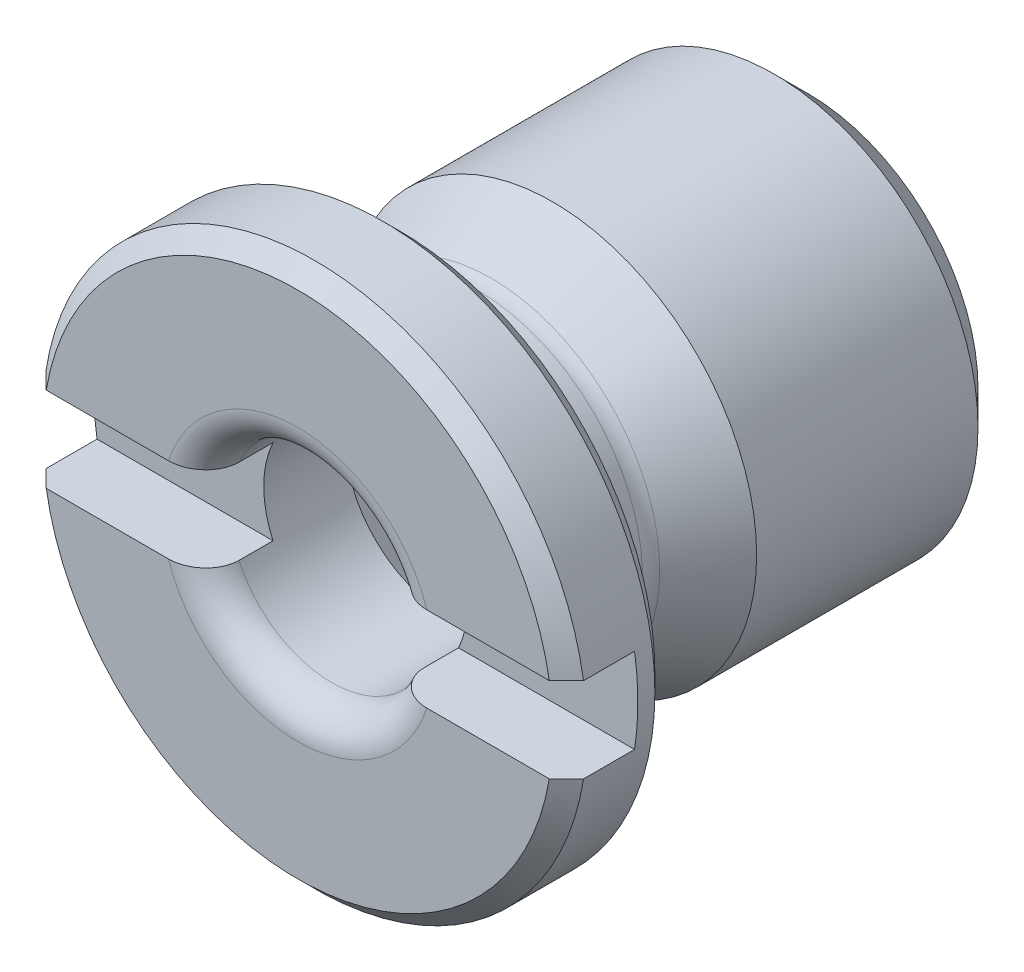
ISO-10303-21;
HEADER;
FILE_DESCRIPTION(('STEP AP214'),'2;1');
FILE_NAME('part.step','',(''),(''),'','','');
FILE_SCHEMA(('AUTOMOTIVE_DESIGN { 1 0 10303 214 1 1 1 1 }'));
ENDSEC;
DATA;
#1=APPLICATION_CONTEXT('core data for automotive mechanical design processes');
#2=APPLICATION_PROTOCOL_DEFINITION('international standard','automotive_design',2000,#1);
#3=PRODUCT_CONTEXT('',#1,'mechanical');
#4=PRODUCT('Part','Part','',(#3));
#5=PRODUCT_RELATED_PRODUCT_CATEGORY('part','',(#4));
#6=PRODUCT_DEFINITION_FORMATION('','',#4);
#7=PRODUCT_DEFINITION_CONTEXT('part definition',#1,'design');
#8=PRODUCT_DEFINITION('design','',#6,#7);
#9=PRODUCT_DEFINITION_SHAPE('','',#8);
#10=(LENGTH_UNIT() NAMED_UNIT(*) SI_UNIT(.MILLI.,.METRE.));
#11=(NAMED_UNIT(*) PLANE_ANGLE_UNIT() SI_UNIT($,.RADIAN.));
#12=(NAMED_UNIT(*) SI_UNIT($,.STERADIAN.) SOLID_ANGLE_UNIT());
#13=UNCERTAINTY_MEASURE_WITH_UNIT(LENGTH_MEASURE(1.E-05),#10,'distance_accuracy_value','');
#14=(GEOMETRIC_REPRESENTATION_CONTEXT(3) GLOBAL_UNCERTAINTY_ASSIGNED_CONTEXT((#13)) GLOBAL_UNIT_ASSIGNED_CONTEXT((#10,
#11,#12)) REPRESENTATION_CONTEXT('',''));
#15=CARTESIAN_POINT('',(0.,0.,0.));
#16=DIRECTION('',(0.,0.,1.));
#17=DIRECTION('',(1.,0.,0.));
#18=AXIS2_PLACEMENT_3D('',#15,#16,#17);
#19=CARTESIAN_POINT('',(0.,8.,3.));
#20=DIRECTION('',(0.,0.,-1.));
#21=DIRECTION('',(-1.,0.,0.));
#22=AXIS2_PLACEMENT_3D('',#19,#20,#21);
#23=PLANE('',#22);
#24=DIRECTION('',(-1.,0.,0.));
#25=VECTOR('',#24,1.);
#26=CARTESIAN_POINT('',(13.,-1.25,3.));
#27=LINE('',#26,#25);
#28=CARTESIAN_POINT('',(7.39509972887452,-1.25,3.));
#29=VERTEX_POINT('',#28);
#30=CARTESIAN_POINT('',(3.79967103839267,-1.25,3.));
#31=VERTEX_POINT('',#30);
#32=EDGE_CURVE('E282',#29,#31,#27,.T.);
#33=ORIENTED_EDGE('',*,*,#32,.T.);
#34=CARTESIAN_POINT('',(0.,0.,3.));
#35=DIRECTION('',(0.,0.,-1.));
#36=DIRECTION('',(-1.,0.,0.));
#37=AXIS2_PLACEMENT_3D('',#34,#35,#36);
#38=CIRCLE('',#37,4.);
#39=CARTESIAN_POINT('',(-3.79967103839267,-1.25,3.));
#40=VERTEX_POINT('',#39);
#41=EDGE_CURVE('E381',#31,#40,#38,.T.);
#42=ORIENTED_EDGE('',*,*,#41,.T.);
#43=CARTESIAN_POINT('',(-7.39509972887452,-1.25,3.));
#44=VERTEX_POINT('',#43);
#45=EDGE_CURVE('E286',#40,#44,#27,.T.);
#46=ORIENTED_EDGE('',*,*,#45,.T.);
#47=CARTESIAN_POINT('',(0.,0.,3.));
#48=DIRECTION('',(0.,0.,-1.));
#49=DIRECTION('',(-1.,0.,0.));
#50=AXIS2_PLACEMENT_3D('',#47,#48,#49);
#51=CIRCLE('',#50,7.5);
#52=EDGE_CURVE('E129',#44,#29,#51,.F.);
#53=ORIENTED_EDGE('',*,*,#52,.T.);
#54=EDGE_LOOP('',(#33,#42,#46,#53));
#55=FACE_BOUND('',#54,.T.);
#56=ADVANCED_FACE('F14',(#55),#23,.F.);
#57=CARTESIAN_POINT('',(0.,0.,2.5));
#58=DIRECTION('',(0.,0.,-1.));
#59=DIRECTION('',(-1.,0.,0.));
#60=AXIS2_PLACEMENT_3D('',#57,#58,#59);
#61=CONICAL_SURFACE('',#60,8.,0.785398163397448);
#62=CARTESIAN_POINT('',(-17.5604533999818,-1.25,-7.10488635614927));
#63=CARTESIAN_POINT('',(-16.950821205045,-1.25,-6.49680525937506));
#64=CARTESIAN_POINT('',(-16.3411209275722,-1.25,-5.88879236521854));
#65=CARTESIAN_POINT('',(-15.1214785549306,-1.25,-4.67297511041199));
#66=CARTESIAN_POINT('',(-14.5115364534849,-1.25,-4.06517075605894));
#67=CARTESIAN_POINT('',(-13.2909447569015,-1.25,-2.84948420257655));
#68=CARTESIAN_POINT('',(-12.680294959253,-1.25,-2.241602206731));
#69=CARTESIAN_POINT('',(-11.458531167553,-1.25,-1.02633810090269));
#70=CARTESIAN_POINT('',(-10.847417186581,-1.25,-0.418955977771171));
#71=CARTESIAN_POINT('',(-9.62720680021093,-1.25,0.792268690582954));
#72=CARTESIAN_POINT('',(-9.01811388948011,-1.25,1.39611475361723));
#73=CARTESIAN_POINT('',(-8.10341366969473,-1.25,2.30086267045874));
#74=CARTESIAN_POINT('',(-7.79832397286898,-1.25,2.60228773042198));
#75=CARTESIAN_POINT('',(-7.18765459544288,-1.25,3.20463642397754));
#76=CARTESIAN_POINT('',(-6.88207491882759,-1.25,3.50556006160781));
#77=CARTESIAN_POINT('',(-6.27031901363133,-1.25,4.10655488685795));
#78=CARTESIAN_POINT('',(-5.96414307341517,-1.25,4.40662636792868));
#79=CARTESIAN_POINT('',(-5.35068118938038,-1.25,5.00565392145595));
#80=CARTESIAN_POINT('',(-5.04339521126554,-1.25,5.30460995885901));
#81=CARTESIAN_POINT('',(-4.58109789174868,-1.25,5.75158524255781));
#82=CARTESIAN_POINT('',(-4.42678181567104,-1.25,5.90032328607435));
#83=CARTESIAN_POINT('',(-4.11752037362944,-1.25,6.19714337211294));
#84=CARTESIAN_POINT('',(-3.9625750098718,-1.25,6.34522541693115));
#85=CARTESIAN_POINT('',(-3.65182467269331,-1.25,6.64046971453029));
#86=CARTESIAN_POINT('',(-3.49601974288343,-1.25,6.78763201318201));
#87=CARTESIAN_POINT('',(-3.18317307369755,-1.25,7.08063490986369));
#88=CARTESIAN_POINT('',(-3.02613135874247,-1.25,7.22647553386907));
#89=CARTESIAN_POINT('',(-2.8250301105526,-1.25,7.4108245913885));
#90=CARTESIAN_POINT('',(-2.78183756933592,-1.25,7.45027895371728));
#91=CARTESIAN_POINT('',(-2.69529179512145,-1.25,7.52901128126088));
#92=CARTESIAN_POINT('',(-2.65193856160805,-1.25,7.56828924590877));
#93=CARTESIAN_POINT('',(-2.52160414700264,-1.25,7.68582638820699));
#94=CARTESIAN_POINT('',(-2.43435172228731,-1.25,7.76378562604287));
#95=CARTESIAN_POINT('',(-2.25872855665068,-1.25,7.91878995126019));
#96=CARTESIAN_POINT('',(-2.17035593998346,-1.25,7.99583291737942));
#97=CARTESIAN_POINT('',(-1.99235025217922,-1.25,8.14843615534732));
#98=CARTESIAN_POINT('',(-1.90271731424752,-1.25,8.22399658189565));
#99=CARTESIAN_POINT('',(-1.7333511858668,-1.25,8.36341345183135));
#100=CARTESIAN_POINT('',(-1.65382849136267,-1.25,8.4275246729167));
#101=CARTESIAN_POINT('',(-1.49299470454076,-1.25,8.55345850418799));
#102=CARTESIAN_POINT('',(-1.41168384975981,-1.25,8.61528141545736));
#103=CARTESIAN_POINT('',(-1.24666606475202,-1.25,8.73549616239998));
#104=CARTESIAN_POINT('',(-1.16296158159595,-1.25,8.79389132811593));
#105=CARTESIAN_POINT('',(-0.992151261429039,-1.25,8.90542519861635));
#106=CARTESIAN_POINT('',(-0.905048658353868,-1.25,8.95856873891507));
#107=CARTESIAN_POINT('',(-0.736300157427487,-1.25,9.05078656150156));
#108=CARTESIAN_POINT('',(-0.65516301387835,-1.25,9.09077392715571));
#109=CARTESIAN_POINT('',(-0.488404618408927,-1.25,9.16009046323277));
#110=CARTESIAN_POINT('',(-0.40279537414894,-1.25,9.18944664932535));
#111=CARTESIAN_POINT('',(-0.27938221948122,-1.25,9.21963281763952));
#112=CARTESIAN_POINT('',(-0.243181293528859,-1.25,9.22707350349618));
#113=CARTESIAN_POINT('',(-0.170299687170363,-1.25,9.23896388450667));
#114=CARTESIAN_POINT('',(-0.133619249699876,-1.25,9.24341503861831));
#115=CARTESIAN_POINT('',(-0.0600463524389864,-1.25,9.24909491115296));
#116=CARTESIAN_POINT('',(-0.0231541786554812,-1.25,9.25032726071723));
#117=CARTESIAN_POINT('',(0.0505870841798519,-1.25,9.2495222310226));
#118=CARTESIAN_POINT('',(0.0874361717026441,-1.25,9.24748473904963));
#119=CARTESIAN_POINT('',(0.197234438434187,-1.25,9.2366140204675));
#120=CARTESIAN_POINT('',(0.269757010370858,-1.25,9.22304623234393));
#121=CARTESIAN_POINT('',(0.376421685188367,-1.25,9.19501276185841));
#122=CARTESIAN_POINT('',(0.411669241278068,-1.25,9.18436851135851));
#123=CARTESIAN_POINT('',(0.481433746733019,-1.25,9.16089365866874));
#124=CARTESIAN_POINT('',(0.515950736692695,-1.25,9.14806317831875));
#125=CARTESIAN_POINT('',(0.599451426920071,-1.25,9.11443359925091));
#126=CARTESIAN_POINT('',(0.648028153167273,-1.25,9.09263122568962));
#127=CARTESIAN_POINT('',(0.743752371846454,-1.25,9.04606609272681));
#128=CARTESIAN_POINT('',(0.790899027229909,-1.25,9.02130163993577));
#129=CARTESIAN_POINT('',(0.930636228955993,-1.25,8.94354849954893));
#130=CARTESIAN_POINT('',(1.02133654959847,-1.25,8.88718184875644));
#131=CARTESIAN_POINT('',(1.19991424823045,-1.25,8.76857603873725));
#132=CARTESIAN_POINT('',(1.28775773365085,-1.25,8.70628736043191));
#133=CARTESIAN_POINT('',(1.41751910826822,-1.25,8.61028376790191));
#134=CARTESIAN_POINT('',(1.46041248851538,-1.25,8.57787540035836));
#135=CARTESIAN_POINT('',(1.54564655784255,-1.25,8.51234314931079));
#136=CARTESIAN_POINT('',(1.58798726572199,-1.25,8.47921929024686));
#137=CARTESIAN_POINT('',(1.72647327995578,-1.25,8.36933062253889));
#138=CARTESIAN_POINT('',(1.82164106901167,-1.25,8.29133479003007));
#139=CARTESIAN_POINT('',(2.01029258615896,-1.25,8.13332745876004));
#140=CARTESIAN_POINT('',(2.10377612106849,-1.25,8.05331573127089));
#141=CARTESIAN_POINT('',(2.28954596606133,-1.25,7.89185697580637));
#142=CARTESIAN_POINT('',(2.38183187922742,-1.25,7.81040949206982));
#143=CARTESIAN_POINT('',(2.56548889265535,-1.25,7.64648823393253));
#144=CARTESIAN_POINT('',(2.65685997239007,-1.25,7.56401443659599));
#145=CARTESIAN_POINT('',(2.9301888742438,-1.25,7.3152315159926));
#146=CARTESIAN_POINT('',(3.11110918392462,-1.25,7.14778371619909));
#147=CARTESIAN_POINT('',(3.47122028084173,-1.25,6.81111827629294));
#148=CARTESIAN_POINT('',(3.65041140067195,-1.25,6.64190099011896));
#149=CARTESIAN_POINT('',(4.00643340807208,-1.25,6.30345611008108));
#150=CARTESIAN_POINT('',(4.18327204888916,-1.25,6.1342366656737));
#151=CARTESIAN_POINT('',(4.5361870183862,-1.25,5.79498793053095));
#152=CARTESIAN_POINT('',(4.71226330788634,-1.25,5.6249585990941));
#153=CARTESIAN_POINT('',(5.06372940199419,-1.25,5.28445006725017));
#154=CARTESIAN_POINT('',(5.23911961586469,-1.25,5.11397128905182));
#155=CARTESIAN_POINT('',(5.58947962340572,-1.25,4.7725881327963));
#156=CARTESIAN_POINT('',(5.76444942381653,-1.25,4.60168376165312));
#157=CARTESIAN_POINT('',(6.42446661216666,-1.25,3.95583307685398));
#158=CARTESIAN_POINT('',(6.90847532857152,-1.25,3.4798256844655));
#159=CARTESIAN_POINT('',(7.87525645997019,-1.25,2.52655148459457));
#160=CARTESIAN_POINT('',(8.35802886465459,-1.25,2.04928466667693));
#161=CARTESIAN_POINT('',(9.32297815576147,-1.25,1.09383964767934));
#162=CARTESIAN_POINT('',(9.80515480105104,-1.25,0.61566120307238));
#163=CARTESIAN_POINT('',(10.7690277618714,-1.25,-0.341176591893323));
#164=CARTESIAN_POINT('',(11.250724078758,-1.25,-0.819835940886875));
#165=CARTESIAN_POINT('',(12.2184744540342,-1.25,-1.78214023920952));
#166=CARTESIAN_POINT('',(12.7045253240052,-1.25,-2.26578839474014));
#167=CARTESIAN_POINT('',(13.6763923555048,-1.25,-3.23332135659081));
#168=CARTESIAN_POINT('',(14.1622085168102,-1.25,-3.71720616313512));
#169=CARTESIAN_POINT('',(15.1335034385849,-1.25,-4.68498319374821));
#170=CARTESIAN_POINT('',(15.6189822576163,-1.25,-5.16887535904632));
#171=CARTESIAN_POINT('',(16.5898072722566,-1.25,-6.13679168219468));
#172=CARTESIAN_POINT('',(17.0751534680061,-1.25,-6.62081583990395));
#173=CARTESIAN_POINT('',(17.5604533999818,-1.25,-7.10488635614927));
#174=B_SPLINE_CURVE_WITH_KNOTS('',3,(#62,#63,#64,#65,#66,#67,#68,#69,#70,#71,#72,#73,#74,#75,
#76,#77,#78,#79,#80,#81,#82,#83,#84,#85,#86,#87,#88,#89,#90,#91,#92,#93,#94,#95,#96,#97,#98,#99,
#100,#101,#102,#103,#104,#105,#106,#107,#108,#109,#110,#111,#112,#113,#114,#115,#116,#117,#118,
#119,#120,#121,#122,#123,#124,#125,#126,#127,#128,#129,#130,#131,#132,#133,#134,#135,#136,#137,
#138,#139,#140,#141,#142,#143,#144,#145,#146,#147,#148,#149,#150,#151,#152,#153,#154,#155,#156,
#157,#158,#159,#160,#161,#162,#163,#164,#165,#166,#167,#168,#169,#170,#171,#172,#173),
.UNSPECIFIED.,.F.,.F.,(4,2,2,2,2,2,2,2,2,2,2,2,2,2,2,2,2,2,2,2,2,2,2,2,2,2,2,2,2,2,2,2,2,2,2,2,
2,2,2,2,2,2,2,2,2,2,2,2,2,2,2,2,2,2,2,4),(0.,2.58316212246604,5.1663963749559,7.75129912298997,
10.3361315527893,12.9091862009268,14.1958214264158,15.4824462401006,16.768555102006,
18.0547040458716,18.6976865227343,19.3406667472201,19.9836146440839,20.6265498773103,
20.8020492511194,20.9775491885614,21.3285632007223,21.6802738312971,22.0319475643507,
22.3383624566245,22.6447368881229,22.9508085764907,23.25659576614,23.5275479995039,
23.7978067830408,23.9085745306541,24.0192881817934,24.1298768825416,24.240469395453,
24.4606980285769,24.5711090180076,24.6815138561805,24.8411128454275,25.000803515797,
25.3207954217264,25.6437486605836,25.805021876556,25.9662895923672,26.3353779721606,
26.704508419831,27.0737582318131,27.4430163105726,28.1825441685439,28.9219268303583,
29.6562008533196,30.3905121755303,31.1242840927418,31.8580441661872,33.8946107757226,
35.9311943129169,37.9684321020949,40.0056641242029,42.0627125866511,44.1197630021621,
46.1761121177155,48.2324590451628),.UNSPECIFIED.);
#175=CARTESIAN_POINT('',(-7.90174031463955,-1.25,2.5));
#176=VERTEX_POINT('',#175);
#177=EDGE_CURVE('E384',#176,#44,#174,.T.);
#178=ORIENTED_EDGE('',*,*,#177,.F.);
#179=CARTESIAN_POINT('',(0.,0.,2.5));
#180=DIRECTION('',(0.,0.,-1.));
#181=DIRECTION('',(-1.,0.,0.));
#182=AXIS2_PLACEMENT_3D('',#179,#180,#181);
#183=CIRCLE('',#182,8.);
#184=CARTESIAN_POINT('',(7.90174031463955,-1.25,2.5));
#185=VERTEX_POINT('',#184);
#186=EDGE_CURVE('E265',#185,#176,#183,.T.);
#187=ORIENTED_EDGE('',*,*,#186,.F.);
#188=EDGE_CURVE('E116',#29,#185,#174,.T.);
#189=ORIENTED_EDGE('',*,*,#188,.F.);
#190=ORIENTED_EDGE('',*,*,#52,.F.);
#191=EDGE_LOOP('',(#178,#187,#189,#190));
#192=FACE_BOUND('',#191,.T.);
#193=ADVANCED_FACE('F196',(#192),#61,.T.);
#194=CARTESIAN_POINT('',(0.,0.,-17.5262382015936));
#195=DIRECTION('',(0.,0.,-1.));
#196=DIRECTION('',(-1.,0.,0.));
#197=AXIS2_PLACEMENT_3D('',#194,#195,#196);
#198=CYLINDRICAL_SURFACE('',#197,4.85);
#199=CARTESIAN_POINT('',(0.,0.,-0.8));
#200=DIRECTION('',(0.,0.,1.));
#201=DIRECTION('',(1.,0.,0.));
#202=AXIS2_PLACEMENT_3D('',#199,#200,#201);
#203=CIRCLE('',#202,4.85);
#204=CARTESIAN_POINT('',(4.85,0.,-0.8));
#205=VERTEX_POINT('',#204);
#206=EDGE_CURVE('E352',#205,#205,#203,.F.);
#207=ORIENTED_EDGE('',*,*,#206,.T.);
#208=EDGE_LOOP('',(#207));
#209=FACE_BOUND('',#208,.T.);
#210=CARTESIAN_POINT('',(0.,0.,-2.2856406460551));
#211=DIRECTION('',(0.,0.,-1.));
#212=DIRECTION('',(-1.,0.,0.));
#213=AXIS2_PLACEMENT_3D('',#210,#211,#212);
#214=CIRCLE('',#213,4.85);
#215=CARTESIAN_POINT('',(-4.85,0.,-2.2856406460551));
#216=VERTEX_POINT('',#215);
#217=EDGE_CURVE('E350',#216,#216,#214,.F.);
#218=ORIENTED_EDGE('',*,*,#217,.T.);
#219=EDGE_LOOP('',(#218));
#220=FACE_BOUND('',#219,.T.);
#221=ADVANCED_FACE('F203',(#209,#220),#198,.T.);
#222=CARTESIAN_POINT('',(0.,0.,-2.5));
#223=DIRECTION('',(0.,0.,-1.));
#224=DIRECTION('',(-1.,0.,0.));
#225=AXIS2_PLACEMENT_3D('',#222,#223,#224);
#226=CONICAL_SURFACE('',#225,4.85,0.523598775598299);
#227=CARTESIAN_POINT('',(0.,0.,-2.68564064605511));
#228=DIRECTION('',(0.,0.,-1.));
#229=DIRECTION('',(-1.,0.,0.));
#230=AXIS2_PLACEMENT_3D('',#227,#228,#229);
#231=CIRCLE('',#230,4.95717967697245);
#232=CARTESIAN_POINT('',(-4.95717967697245,0.,-2.68564064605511));
#233=VERTEX_POINT('',#232);
#234=EDGE_CURVE('E9',#233,#233,#231,.T.);
#235=ORIENTED_EDGE('',*,*,#234,.T.);
#236=EDGE_LOOP('',(#235));
#237=FACE_BOUND('',#236,.T.);
#238=CARTESIAN_POINT('',(0.,0.,-4.49185842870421));
#239=DIRECTION('',(0.,0.,-1.));
#240=DIRECTION('',(-1.,0.,0.));
#241=AXIS2_PLACEMENT_3D('',#238,#239,#240);
#242=CIRCLE('',#241,6.);
#243=CARTESIAN_POINT('',(-6.,0.,-4.49185842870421));
#244=VERTEX_POINT('',#243);
#245=EDGE_CURVE('E266',#244,#244,#242,.T.);
#246=ORIENTED_EDGE('',*,*,#245,.F.);
#247=EDGE_LOOP('',(#246));
#248=FACE_BOUND('',#247,.T.);
#249=ADVANCED_FACE('F242',(#237,#248),#226,.T.);
#250=CARTESIAN_POINT('',(0.,0.,-17.5262382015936));
#251=DIRECTION('',(0.,0.,-1.));
#252=DIRECTION('',(-1.,0.,0.));
#253=AXIS2_PLACEMENT_3D('',#250,#251,#252);
#254=CYLINDRICAL_SURFACE('',#253,6.);
#255=CARTESIAN_POINT('',(0.,0.,-11.));
#256=DIRECTION('',(0.,0.,-1.));
#257=DIRECTION('',(-1.,0.,0.));
#258=AXIS2_PLACEMENT_3D('',#255,#256,#257);
#259=CIRCLE('',#258,6.);
#260=CARTESIAN_POINT('',(-6.,0.,-11.));
#261=VERTEX_POINT('',#260);
#262=EDGE_CURVE('E270',#261,#261,#259,.T.);
#263=ORIENTED_EDGE('',*,*,#262,.F.);
#264=EDGE_LOOP('',(#263));
#265=FACE_BOUND('',#264,.T.);
#266=ORIENTED_EDGE('',*,*,#245,.T.);
#267=EDGE_LOOP('',(#266));
#268=FACE_BOUND('',#267,.T.);
#269=ADVANCED_FACE('F238',(#265,#268),#254,.T.);
#270=CARTESIAN_POINT('',(0.,0.,-11.));
#271=DIRECTION('',(0.,0.,1.));
#272=DIRECTION('',(1.,0.,0.));
#273=AXIS2_PLACEMENT_3D('',#270,#271,#272);
#274=CONICAL_SURFACE('',#273,6.,0.785398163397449);
#275=CARTESIAN_POINT('',(0.,0.,-12.));
#276=DIRECTION('',(0.,0.,-1.));
#277=DIRECTION('',(-1.,0.,0.));
#278=AXIS2_PLACEMENT_3D('',#275,#276,#277);
#279=CIRCLE('',#278,5.);
#280=CARTESIAN_POINT('',(-5.,0.,-12.));
#281=VERTEX_POINT('',#280);
#282=EDGE_CURVE('E316',#281,#281,#279,.T.);
#283=ORIENTED_EDGE('',*,*,#282,.F.);
#284=EDGE_LOOP('',(#283));
#285=FACE_BOUND('',#284,.T.);
#286=ORIENTED_EDGE('',*,*,#262,.T.);
#287=EDGE_LOOP('',(#286));
#288=FACE_BOUND('',#287,.T.);
#289=ADVANCED_FACE('F234',(#285,#288),#274,.T.);
#290=CARTESIAN_POINT('',(0.,5.,-12.));
#291=DIRECTION('',(0.,0.,1.));
#292=DIRECTION('',(1.,0.,0.));
#293=AXIS2_PLACEMENT_3D('',#290,#291,#292);
#294=PLANE('',#293);
#295=CARTESIAN_POINT('',(0.,0.,-12.));
#296=DIRECTION('',(0.,0.,-1.));
#297=DIRECTION('',(-1.,0.,0.));
#298=AXIS2_PLACEMENT_3D('',#295,#296,#297);
#299=CIRCLE('',#298,4.);
#300=CARTESIAN_POINT('',(-4.,0.,-12.));
#301=VERTEX_POINT('',#300);
#302=EDGE_CURVE('E313',#301,#301,#299,.T.);
#303=ORIENTED_EDGE('',*,*,#302,.F.);
#304=EDGE_LOOP('',(#303));
#305=FACE_BOUND('',#304,.T.);
#306=ORIENTED_EDGE('',*,*,#282,.T.);
#307=EDGE_LOOP('',(#306));
#308=FACE_BOUND('',#307,.T.);
#309=ADVANCED_FACE('F230',(#305,#308),#294,.F.);
#310=CARTESIAN_POINT('',(0.,0.,-17.5262382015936));
#311=DIRECTION('',(0.,0.,-1.));
#312=DIRECTION('',(-1.,0.,0.));
#313=AXIS2_PLACEMENT_3D('',#310,#311,#312);
#314=CYLINDRICAL_SURFACE('',#313,4.);
#315=CARTESIAN_POINT('',(0.,0.,-3.13205080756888));
#316=DIRECTION('',(0.,0.,-1.));
#317=DIRECTION('',(-1.,0.,0.));
#318=AXIS2_PLACEMENT_3D('',#315,#316,#317);
#319=CIRCLE('',#318,4.);
#320=CARTESIAN_POINT('',(-4.,0.,-3.13205080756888));
#321=VERTEX_POINT('',#320);
#322=EDGE_CURVE('E310',#321,#321,#319,.T.);
#323=ORIENTED_EDGE('',*,*,#322,.F.);
#324=EDGE_LOOP('',(#323));
#325=FACE_BOUND('',#324,.T.);
#326=ORIENTED_EDGE('',*,*,#302,.T.);
#327=EDGE_LOOP('',(#326));
#328=FACE_BOUND('',#327,.T.);
#329=ADVANCED_FACE('F222',(#325,#328),#314,.F.);
#330=CARTESIAN_POINT('',(0.,0.,-3.13205080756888));
#331=DIRECTION('',(0.,0.,-1.));
#332=DIRECTION('',(-1.,0.,0.));
#333=AXIS2_PLACEMENT_3D('',#330,#331,#332);
#334=CONICAL_SURFACE('',#333,4.,0.523598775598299);
#335=CARTESIAN_POINT('',(0.,0.,-1.4));
#336=DIRECTION('',(0.,0.,-1.));
#337=DIRECTION('',(-1.,0.,0.));
#338=AXIS2_PLACEMENT_3D('',#335,#336,#337);
#339=CIRCLE('',#338,3.);
#340=CARTESIAN_POINT('',(-3.,0.,-1.4));
#341=VERTEX_POINT('',#340);
#342=EDGE_CURVE('E307',#341,#341,#339,.T.);
#343=ORIENTED_EDGE('',*,*,#342,.F.);
#344=EDGE_LOOP('',(#343));
#345=FACE_BOUND('',#344,.T.);
#346=ORIENTED_EDGE('',*,*,#322,.T.);
#347=EDGE_LOOP('',(#346));
#348=FACE_BOUND('',#347,.T.);
#349=ADVANCED_FACE('F216',(#345,#348),#334,.F.);
#350=CARTESIAN_POINT('',(0.,0.,-17.5262382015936));
#351=DIRECTION('',(0.,0.,-1.));
#352=DIRECTION('',(-1.,0.,0.));
#353=AXIS2_PLACEMENT_3D('',#350,#351,#352);
#354=CYLINDRICAL_SURFACE('',#353,3.);
#355=DIRECTION('',(0.,0.,-1.));
#356=VECTOR('',#355,1.);
#357=CARTESIAN_POINT('',(-2.72717802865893,-1.25,-17.5262382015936));
#358=LINE('',#357,#356);
#359=CARTESIAN_POINT('',(-2.72717802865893,-1.25,1.));
#360=VERTEX_POINT('',#359);
#361=CARTESIAN_POINT('',(-2.72717802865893,-1.25,2.));
#362=VERTEX_POINT('',#361);
#363=EDGE_CURVE('E301',#360,#362,#358,.F.);
#364=ORIENTED_EDGE('',*,*,#363,.T.);
#365=CARTESIAN_POINT('',(0.,0.,2.));
#366=DIRECTION('',(0.,0.,-1.));
#367=DIRECTION('',(-1.,0.,0.));
#368=AXIS2_PLACEMENT_3D('',#365,#366,#367);
#369=CIRCLE('',#368,3.);
#370=CARTESIAN_POINT('',(2.72717802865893,-1.25,2.));
#371=VERTEX_POINT('',#370);
#372=EDGE_CURVE('E362',#362,#371,#369,.F.);
#373=ORIENTED_EDGE('',*,*,#372,.T.);
#374=DIRECTION('',(0.,0.,-1.));
#375=VECTOR('',#374,1.);
#376=CARTESIAN_POINT('',(2.72717802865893,-1.25,-17.5262382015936));
#377=LINE('',#376,#375);
#378=CARTESIAN_POINT('',(2.72717802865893,-1.25,1.));
#379=VERTEX_POINT('',#378);
#380=EDGE_CURVE('E299',#371,#379,#377,.T.);
#381=ORIENTED_EDGE('',*,*,#380,.T.);
#382=CARTESIAN_POINT('',(0.,0.,1.));
#383=DIRECTION('',(0.,0.,-1.));
#384=DIRECTION('',(0.,-1.,0.));
#385=AXIS2_PLACEMENT_3D('',#382,#383,#384);
#386=CIRCLE('',#385,3.);
#387=CARTESIAN_POINT('',(2.72717802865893,1.25,1.));
#388=VERTEX_POINT('',#387);
#389=EDGE_CURVE('E306',#379,#388,#386,.F.);
#390=ORIENTED_EDGE('',*,*,#389,.T.);
#391=DIRECTION('',(0.,0.,-1.));
#392=VECTOR('',#391,1.);
#393=CARTESIAN_POINT('',(2.72717802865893,1.25,-17.5262382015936));
#394=LINE('',#393,#392);
#395=CARTESIAN_POINT('',(2.72717802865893,1.25,2.));
#396=VERTEX_POINT('',#395);
#397=EDGE_CURVE('E291',#388,#396,#394,.F.);
#398=ORIENTED_EDGE('',*,*,#397,.T.);
#399=CARTESIAN_POINT('',(0.,0.,2.));
#400=DIRECTION('',(0.,0.,-1.));
#401=DIRECTION('',(-1.,0.,0.));
#402=AXIS2_PLACEMENT_3D('',#399,#400,#401);
#403=CIRCLE('',#402,3.);
#404=CARTESIAN_POINT('',(-2.72717802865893,1.25,2.));
#405=VERTEX_POINT('',#404);
#406=EDGE_CURVE('E349',#396,#405,#403,.F.);
#407=ORIENTED_EDGE('',*,*,#406,.T.);
#408=DIRECTION('',(0.,0.,-1.));
#409=VECTOR('',#408,1.);
#410=CARTESIAN_POINT('',(-2.72717802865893,1.25,-17.5262382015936));
#411=LINE('',#410,#409);
#412=CARTESIAN_POINT('',(-2.72717802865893,1.25,1.));
#413=VERTEX_POINT('',#412);
#414=EDGE_CURVE('E284',#405,#413,#411,.T.);
#415=ORIENTED_EDGE('',*,*,#414,.T.);
#416=EDGE_CURVE('E303',#413,#360,#386,.F.);
#417=ORIENTED_EDGE('',*,*,#416,.T.);
#418=EDGE_LOOP('',(#364,#373,#381,#390,#398,#407,#415,#417));
#419=FACE_BOUND('',#418,.T.);
#420=ORIENTED_EDGE('',*,*,#342,.T.);
#421=EDGE_LOOP('',(#420));
#422=FACE_BOUND('',#421,.T.);
#423=ADVANCED_FACE('F209',(#419,#422),#354,.F.);
#424=DIRECTION('',(-1.,0.,0.));
#425=VECTOR('',#424,1.);
#426=CARTESIAN_POINT('',(13.,1.25,3.));
#427=LINE('',#426,#425);
#428=CARTESIAN_POINT('',(-3.79967103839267,1.25,3.));
#429=VERTEX_POINT('',#428);
#430=CARTESIAN_POINT('',(-7.39509972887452,1.25,3.));
#431=VERTEX_POINT('',#430);
#432=EDGE_CURVE('E125',#429,#431,#427,.T.);
#433=ORIENTED_EDGE('',*,*,#432,.F.);
#434=CARTESIAN_POINT('',(0.,0.,3.));
#435=DIRECTION('',(0.,0.,-1.));
#436=DIRECTION('',(-1.,0.,0.));
#437=AXIS2_PLACEMENT_3D('',#434,#435,#436);
#438=CIRCLE('',#437,4.);
#439=CARTESIAN_POINT('',(3.79967103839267,1.25,3.));
#440=VERTEX_POINT('',#439);
#441=EDGE_CURVE('E123',#429,#440,#438,.T.);
#442=ORIENTED_EDGE('',*,*,#441,.T.);
#443=CARTESIAN_POINT('',(7.39509972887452,1.25,3.));
#444=VERTEX_POINT('',#443);
#445=EDGE_CURVE('E108',#444,#440,#427,.T.);
#446=ORIENTED_EDGE('',*,*,#445,.F.);
#447=EDGE_CURVE('E122',#444,#431,#51,.F.);
#448=ORIENTED_EDGE('',*,*,#447,.T.);
#449=EDGE_LOOP('',(#433,#442,#446,#448));
#450=FACE_BOUND('',#449,.T.);
#451=ADVANCED_FACE('F121',(#450),#23,.F.);
#452=CARTESIAN_POINT('',(0.,0.,-17.5262382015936));
#453=DIRECTION('',(0.,0.,-1.));
#454=DIRECTION('',(-1.,0.,0.));
#455=AXIS2_PLACEMENT_3D('',#452,#453,#454);
#456=CYLINDRICAL_SURFACE('',#455,8.);
#457=CARTESIAN_POINT('',(0.,0.,0.500000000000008));
#458=DIRECTION('',(0.,0.,1.));
#459=DIRECTION('',(1.,0.,0.));
#460=AXIS2_PLACEMENT_3D('',#457,#458,#459);
#461=CIRCLE('',#460,8.);
#462=CARTESIAN_POINT('',(8.,0.,0.500000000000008));
#463=VERTEX_POINT('',#462);
#464=EDGE_CURVE('E130',#463,#463,#461,.T.);
#465=ORIENTED_EDGE('',*,*,#464,.T.);
#466=EDGE_LOOP('',(#465));
#467=FACE_BOUND('',#466,.T.);
#468=CARTESIAN_POINT('',(0.,0.,1.));
#469=DIRECTION('',(0.,0.,-1.));
#470=DIRECTION('',(0.,-1.,0.));
#471=AXIS2_PLACEMENT_3D('',#468,#469,#470);
#472=CIRCLE('',#471,8.);
#473=CARTESIAN_POINT('',(7.90174031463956,1.25,1.));
#474=VERTEX_POINT('',#473);
#475=CARTESIAN_POINT('',(7.90174031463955,-1.25,1.));
#476=VERTEX_POINT('',#475);
#477=EDGE_CURVE('E383',#474,#476,#472,.T.);
#478=ORIENTED_EDGE('',*,*,#477,.T.);
#479=DIRECTION('',(0.,0.,-1.));
#480=VECTOR('',#479,1.);
#481=CARTESIAN_POINT('',(7.90174031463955,-1.25,-17.5262382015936));
#482=LINE('',#481,#480);
#483=EDGE_CURVE('E294',#476,#185,#482,.F.);
#484=ORIENTED_EDGE('',*,*,#483,.T.);
#485=ORIENTED_EDGE('',*,*,#186,.T.);
#486=DIRECTION('',(0.,0.,-1.));
#487=VECTOR('',#486,1.);
#488=CARTESIAN_POINT('',(-7.90174031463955,-1.25,-17.5262382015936));
#489=LINE('',#488,#487);
#490=CARTESIAN_POINT('',(-7.90174031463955,-1.25,1.));
#491=VERTEX_POINT('',#490);
#492=EDGE_CURVE('E297',#176,#491,#489,.T.);
#493=ORIENTED_EDGE('',*,*,#492,.T.);
#494=CARTESIAN_POINT('',(-7.90174031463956,1.25,1.));
#495=VERTEX_POINT('',#494);
#496=EDGE_CURVE('E279',#491,#495,#472,.T.);
#497=ORIENTED_EDGE('',*,*,#496,.T.);
#498=DIRECTION('',(0.,0.,-1.));
#499=VECTOR('',#498,1.);
#500=CARTESIAN_POINT('',(-7.90174031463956,1.25,-17.5262382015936));
#501=LINE('',#500,#499);
#502=CARTESIAN_POINT('',(-7.90174031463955,1.25,2.5));
#503=VERTEX_POINT('',#502);
#504=EDGE_CURVE('E277',#495,#503,#501,.F.);
#505=ORIENTED_EDGE('',*,*,#504,.T.);
#506=CARTESIAN_POINT('',(7.90174031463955,1.25,2.5));
#507=VERTEX_POINT('',#506);
#508=EDGE_CURVE('E134',#503,#507,#183,.T.);
#509=ORIENTED_EDGE('',*,*,#508,.T.);
#510=DIRECTION('',(0.,0.,-1.));
#511=VECTOR('',#510,1.);
#512=CARTESIAN_POINT('',(7.90174031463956,1.25,-17.5262382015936));
#513=LINE('',#512,#511);
#514=EDGE_CURVE('E111',#507,#474,#513,.T.);
#515=ORIENTED_EDGE('',*,*,#514,.T.);
#516=EDGE_LOOP('',(#478,#484,#485,#493,#497,#505,#509,#515));
#517=FACE_BOUND('',#516,.T.);
#518=ADVANCED_FACE('F208',(#467,#517),#456,.T.);
#519=CARTESIAN_POINT('',(0.,8.,0.));
#520=DIRECTION('',(0.,0.,1.));
#521=DIRECTION('',(1.,0.,0.));
#522=AXIS2_PLACEMENT_3D('',#519,#520,#521);
#523=PLANE('',#522);
#524=CARTESIAN_POINT('',(0.,0.,0.));
#525=DIRECTION('',(0.,0.,1.));
#526=DIRECTION('',(1.,0.,0.));
#527=AXIS2_PLACEMENT_3D('',#524,#525,#526);
#528=CIRCLE('',#527,5.65);
#529=CARTESIAN_POINT('',(5.65,0.,0.));
#530=VERTEX_POINT('',#529);
#531=EDGE_CURVE('E22',#530,#530,#528,.T.);
#532=ORIENTED_EDGE('',*,*,#531,.T.);
#533=EDGE_LOOP('',(#532));
#534=FACE_BOUND('',#533,.T.);
#535=CARTESIAN_POINT('',(0.,0.,0.));
#536=DIRECTION('',(0.,0.,1.));
#537=DIRECTION('',(1.,0.,0.));
#538=AXIS2_PLACEMENT_3D('',#535,#536,#537);
#539=CIRCLE('',#538,7.5);
#540=CARTESIAN_POINT('',(7.5,0.,0.));
#541=VERTEX_POINT('',#540);
#542=EDGE_CURVE('E263',#541,#541,#539,.F.);
#543=ORIENTED_EDGE('',*,*,#542,.T.);
#544=EDGE_LOOP('',(#543));
#545=FACE_BOUND('',#544,.T.);
#546=ADVANCED_FACE('F161',(#534,#545),#523,.F.);
#547=CARTESIAN_POINT('',(0.,0.,0.));
#548=DIRECTION('',(0.,0.,1.));
#549=DIRECTION('',(1.,0.,0.));
#550=AXIS2_PLACEMENT_3D('',#547,#548,#549);
#551=CONICAL_SURFACE('',#550,7.5,0.785398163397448);
#552=ORIENTED_EDGE('',*,*,#464,.F.);
#553=EDGE_LOOP('',(#552));
#554=FACE_BOUND('',#553,.T.);
#555=ORIENTED_EDGE('',*,*,#542,.F.);
#556=EDGE_LOOP('',(#555));
#557=FACE_BOUND('',#556,.T.);
#558=ADVANCED_FACE('F249',(#554,#557),#551,.T.);
#559=CARTESIAN_POINT('',(17.5604533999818,1.25,-7.10488635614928));
#560=CARTESIAN_POINT('',(16.950821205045,1.25,-6.49680525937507));
#561=CARTESIAN_POINT('',(16.3411209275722,1.25,-5.88879236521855));
#562=CARTESIAN_POINT('',(15.1214785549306,1.25,-4.672975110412));
#563=CARTESIAN_POINT('',(14.5115364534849,1.25,-4.06517075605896));
#564=CARTESIAN_POINT('',(13.2909447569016,1.25,-2.84948420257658));
#565=CARTESIAN_POINT('',(12.6802949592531,1.25,-2.24160220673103));
#566=CARTESIAN_POINT('',(11.458531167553,1.25,-1.02633810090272));
#567=CARTESIAN_POINT('',(10.847417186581,1.25,-0.418955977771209));
#568=CARTESIAN_POINT('',(9.62720680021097,1.25,0.792268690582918));
#569=CARTESIAN_POINT('',(9.01811388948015,1.25,1.39611475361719));
#570=CARTESIAN_POINT('',(8.10341366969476,1.25,2.30086267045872));
#571=CARTESIAN_POINT('',(7.79832397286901,1.25,2.60228773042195));
#572=CARTESIAN_POINT('',(7.1876545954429,1.25,3.20463642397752));
#573=CARTESIAN_POINT('',(6.88207491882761,1.25,3.50556006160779));
#574=CARTESIAN_POINT('',(6.27031901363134,1.25,4.10655488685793));
#575=CARTESIAN_POINT('',(5.96414307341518,1.25,4.40662636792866));
#576=CARTESIAN_POINT('',(5.35068118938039,1.25,5.00565392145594));
#577=CARTESIAN_POINT('',(5.04339521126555,1.25,5.304609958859));
#578=CARTESIAN_POINT('',(4.58109789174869,1.25,5.7515852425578));
#579=CARTESIAN_POINT('',(4.42678181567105,1.25,5.90032328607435));
#580=CARTESIAN_POINT('',(4.11752037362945,1.25,6.19714337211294));
#581=CARTESIAN_POINT('',(3.9625750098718,1.25,6.34522541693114));
#582=CARTESIAN_POINT('',(3.65182467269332,1.25,6.64046971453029));
#583=CARTESIAN_POINT('',(3.49601974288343,1.25,6.78763201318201));
#584=CARTESIAN_POINT('',(3.18317307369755,1.25,7.08063490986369));
#585=CARTESIAN_POINT('',(3.02613135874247,1.25,7.22647553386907));
#586=CARTESIAN_POINT('',(2.8250301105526,1.25,7.4108245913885));
#587=CARTESIAN_POINT('',(2.78183756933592,1.25,7.45027895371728));
#588=CARTESIAN_POINT('',(2.69529179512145,1.25,7.52901128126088));
#589=CARTESIAN_POINT('',(2.65193856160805,1.25,7.56828924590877));
#590=CARTESIAN_POINT('',(2.52160414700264,1.25,7.68582638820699));
#591=CARTESIAN_POINT('',(2.43435172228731,1.25,7.76378562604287));
#592=CARTESIAN_POINT('',(2.25872855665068,1.25,7.91878995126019));
#593=CARTESIAN_POINT('',(2.17035593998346,1.25,7.99583291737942));
#594=CARTESIAN_POINT('',(1.99235025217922,1.25,8.14843615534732));
#595=CARTESIAN_POINT('',(1.90271731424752,1.25,8.22399658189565));
#596=CARTESIAN_POINT('',(1.7333511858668,1.25,8.36341345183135));
#597=CARTESIAN_POINT('',(1.65382849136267,1.25,8.4275246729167));
#598=CARTESIAN_POINT('',(1.49299470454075,1.25,8.55345850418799));
#599=CARTESIAN_POINT('',(1.41168384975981,1.25,8.61528141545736));
#600=CARTESIAN_POINT('',(1.24666606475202,1.25,8.73549616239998));
#601=CARTESIAN_POINT('',(1.16296158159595,1.25,8.79389132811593));
#602=CARTESIAN_POINT('',(0.992151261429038,1.25,8.90542519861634));
#603=CARTESIAN_POINT('',(0.905048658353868,1.25,8.95856873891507));
#604=CARTESIAN_POINT('',(0.736300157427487,1.25,9.05078656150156));
#605=CARTESIAN_POINT('',(0.655163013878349,1.25,9.09077392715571));
#606=CARTESIAN_POINT('',(0.488404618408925,1.25,9.16009046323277));
#607=CARTESIAN_POINT('',(0.402795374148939,1.25,9.18944664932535));
#608=CARTESIAN_POINT('',(0.27938221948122,1.25,9.21963281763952));
#609=CARTESIAN_POINT('',(0.24318129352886,1.25,9.22707350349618));
#610=CARTESIAN_POINT('',(0.170299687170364,1.25,9.23896388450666));
#611=CARTESIAN_POINT('',(0.133619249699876,1.25,9.24341503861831));
#612=CARTESIAN_POINT('',(0.0600463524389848,1.25,9.24909491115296));
#613=CARTESIAN_POINT('',(0.0231541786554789,1.25,9.25032726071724));
#614=CARTESIAN_POINT('',(-0.0505870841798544,1.25,9.2495222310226));
#615=CARTESIAN_POINT('',(-0.087436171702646,1.25,9.24748473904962));
#616=CARTESIAN_POINT('',(-0.197234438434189,1.25,9.23661402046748));
#617=CARTESIAN_POINT('',(-0.269757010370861,1.25,9.22304623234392));
#618=CARTESIAN_POINT('',(-0.376421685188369,1.25,9.19501276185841));
#619=CARTESIAN_POINT('',(-0.411669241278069,1.25,9.18436851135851));
#620=CARTESIAN_POINT('',(-0.48143374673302,1.25,9.16089365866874));
#621=CARTESIAN_POINT('',(-0.515950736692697,1.25,9.14806317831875));
#622=CARTESIAN_POINT('',(-0.599451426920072,1.25,9.11443359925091));
#623=CARTESIAN_POINT('',(-0.648028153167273,1.25,9.09263122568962));
#624=CARTESIAN_POINT('',(-0.743752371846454,1.25,9.04606609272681));
#625=CARTESIAN_POINT('',(-0.79089902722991,1.25,9.02130163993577));
#626=CARTESIAN_POINT('',(-0.930636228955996,1.25,8.94354849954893));
#627=CARTESIAN_POINT('',(-1.02133654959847,1.25,8.88718184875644));
#628=CARTESIAN_POINT('',(-1.19991424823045,1.25,8.76857603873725));
#629=CARTESIAN_POINT('',(-1.28775773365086,1.25,8.7062873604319));
#630=CARTESIAN_POINT('',(-1.41751910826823,1.25,8.6102837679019));
#631=CARTESIAN_POINT('',(-1.46041248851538,1.25,8.57787540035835));
#632=CARTESIAN_POINT('',(-1.54564655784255,1.25,8.51234314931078));
#633=CARTESIAN_POINT('',(-1.587987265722,1.25,8.47921929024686));
#634=CARTESIAN_POINT('',(-1.72647327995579,1.25,8.3693306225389));
#635=CARTESIAN_POINT('',(-1.82164106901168,1.25,8.29133479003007));
#636=CARTESIAN_POINT('',(-2.01029258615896,1.25,8.13332745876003));
#637=CARTESIAN_POINT('',(-2.1037761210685,1.25,8.05331573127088));
#638=CARTESIAN_POINT('',(-2.28954596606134,1.25,7.89185697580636));
#639=CARTESIAN_POINT('',(-2.38183187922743,1.25,7.81040949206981));
#640=CARTESIAN_POINT('',(-2.56548889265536,1.25,7.64648823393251));
#641=CARTESIAN_POINT('',(-2.65685997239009,1.25,7.56401443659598));
#642=CARTESIAN_POINT('',(-2.93018887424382,1.25,7.31523151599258));
#643=CARTESIAN_POINT('',(-3.11110918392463,1.25,7.14778371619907));
#644=CARTESIAN_POINT('',(-3.47122028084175,1.25,6.81111827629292));
#645=CARTESIAN_POINT('',(-3.65041140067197,1.25,6.64190099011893));
#646=CARTESIAN_POINT('',(-4.00643340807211,1.25,6.30345611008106));
#647=CARTESIAN_POINT('',(-4.18327204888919,1.25,6.13423666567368));
#648=CARTESIAN_POINT('',(-4.53618701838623,1.25,5.79498793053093));
#649=CARTESIAN_POINT('',(-4.71226330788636,1.25,5.62495859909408));
#650=CARTESIAN_POINT('',(-5.06372940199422,1.25,5.28445006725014));
#651=CARTESIAN_POINT('',(-5.23911961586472,1.25,5.11397128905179));
#652=CARTESIAN_POINT('',(-5.58947962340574,1.25,4.77258813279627));
#653=CARTESIAN_POINT('',(-5.76444942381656,1.25,4.60168376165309));
#654=CARTESIAN_POINT('',(-6.42446661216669,1.25,3.95583307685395));
#655=CARTESIAN_POINT('',(-6.90847532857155,1.25,3.47982568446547));
#656=CARTESIAN_POINT('',(-7.87525645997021,1.25,2.52655148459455));
#657=CARTESIAN_POINT('',(-8.35802886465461,1.25,2.04928466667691));
#658=CARTESIAN_POINT('',(-9.32297815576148,1.25,1.09383964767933));
#659=CARTESIAN_POINT('',(-9.80515480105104,1.25,0.615661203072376));
#660=CARTESIAN_POINT('',(-10.7690277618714,1.25,-0.34117659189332));
#661=CARTESIAN_POINT('',(-11.250724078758,1.25,-0.81983594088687));
#662=CARTESIAN_POINT('',(-12.2184744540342,1.25,-1.78214023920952));
#663=CARTESIAN_POINT('',(-12.7045253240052,1.25,-2.26578839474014));
#664=CARTESIAN_POINT('',(-13.6763923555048,1.25,-3.23332135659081));
#665=CARTESIAN_POINT('',(-14.1622085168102,1.25,-3.71720616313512));
#666=CARTESIAN_POINT('',(-15.1335034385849,1.25,-4.68498319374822));
#667=CARTESIAN_POINT('',(-15.6189822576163,1.25,-5.16887535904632));
#668=CARTESIAN_POINT('',(-16.5898072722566,1.25,-6.13679168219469));
#669=CARTESIAN_POINT('',(-17.0751534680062,1.25,-6.62081583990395));
#670=CARTESIAN_POINT('',(-17.5604533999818,1.25,-7.10488635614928));
#671=B_SPLINE_CURVE_WITH_KNOTS('',3,(#559,#560,#561,#562,#563,#564,#565,#566,#567,#568,#569,
#570,#571,#572,#573,#574,#575,#576,#577,#578,#579,#580,#581,#582,#583,#584,#585,#586,#587,#588,
#589,#590,#591,#592,#593,#594,#595,#596,#597,#598,#599,#600,#601,#602,#603,#604,#605,#606,#607,
#608,#609,#610,#611,#612,#613,#614,#615,#616,#617,#618,#619,#620,#621,#622,#623,#624,#625,#626,
#627,#628,#629,#630,#631,#632,#633,#634,#635,#636,#637,#638,#639,#640,#641,#642,#643,#644,#645,
#646,#647,#648,#649,#650,#651,#652,#653,#654,#655,#656,#657,#658,#659,#660,#661,#662,#663,#664,
#665,#666,#667,#668,#669,#670),.UNSPECIFIED.,.F.,.F.,(4,2,2,2,2,2,2,2,2,2,2,2,2,2,2,2,2,2,2,2,2,
2,2,2,2,2,2,2,2,2,2,2,2,2,2,2,2,2,2,2,2,2,2,2,2,2,2,2,2,2,2,2,2,2,2,4),(0.,2.58316212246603,
5.16639637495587,7.75129912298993,10.3361315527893,12.9091862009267,14.1958214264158,
15.4824462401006,16.7685551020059,18.0547040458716,18.6976865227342,19.3406667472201,
19.9836146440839,20.6265498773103,20.8020492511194,20.9775491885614,21.3285632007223,
21.6802738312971,22.0319475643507,22.3383624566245,22.6447368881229,22.9508085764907,
23.25659576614,23.5275479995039,23.7978067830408,23.9085745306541,24.0192881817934,
24.1298768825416,24.240469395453,24.4606980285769,24.5711090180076,24.6815138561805,
24.8411128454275,25.000803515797,25.3207954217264,25.6437486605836,25.805021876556,
25.9662895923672,26.3353779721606,26.704508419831,27.0737582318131,27.4430163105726,
28.182544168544,28.9219268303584,29.6562008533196,30.3905121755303,31.1242840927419,
31.8580441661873,33.8946107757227,35.931194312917,37.968432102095,40.0056641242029,
42.0627125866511,44.1197630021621,46.1761121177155,48.2324590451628),.UNSPECIFIED.);
#672=EDGE_CURVE('E105',#507,#444,#671,.T.);
#673=ORIENTED_EDGE('',*,*,#672,.F.);
#674=ORIENTED_EDGE('',*,*,#508,.F.);
#675=EDGE_CURVE('E117',#431,#503,#671,.T.);
#676=ORIENTED_EDGE('',*,*,#675,.F.);
#677=ORIENTED_EDGE('',*,*,#447,.F.);
#678=EDGE_LOOP('',(#673,#674,#676,#677));
#679=FACE_BOUND('',#678,.T.);
#680=ADVANCED_FACE('F128',(#679),#61,.T.);
#681=CARTESIAN_POINT('',(13.,-1.25,3.));
#682=DIRECTION('',(0.,-1.,0.));
#683=DIRECTION('',(1.,0.,0.));
#684=AXIS2_PLACEMENT_3D('',#681,#682,#683);
#685=PLANE('',#684);
#686=ORIENTED_EDGE('',*,*,#45,.F.);
#687=CARTESIAN_POINT('',(-3.79967103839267,-1.25,3.));
#688=CARTESIAN_POINT('',(-3.73678690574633,-1.25,3.00003379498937));
#689=CARTESIAN_POINT('',(-3.67392791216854,-1.25,2.99464950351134));
#690=CARTESIAN_POINT('',(-3.54999060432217,-1.25,2.97346188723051));
#691=CARTESIAN_POINT('',(-3.48891220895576,-1.25,2.95765903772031));
#692=CARTESIAN_POINT('',(-3.37024357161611,-1.25,2.91604545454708));
#693=CARTESIAN_POINT('',(-3.31265432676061,-1.25,2.8902318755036));
#694=CARTESIAN_POINT('',(-3.20267254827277,-1.25,2.82922762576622));
#695=CARTESIAN_POINT('',(-3.15027930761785,-1.25,2.79403823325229));
#696=CARTESIAN_POINT('',(-3.05285820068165,-1.25,2.71545576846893));
#697=CARTESIAN_POINT('',(-3.00776488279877,-1.25,2.6721440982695));
#698=CARTESIAN_POINT('',(-2.92604994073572,-1.25,2.57811291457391));
#699=CARTESIAN_POINT('',(-2.88942752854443,-1.25,2.52739409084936));
#700=CARTESIAN_POINT('',(-2.82829645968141,-1.25,2.42326776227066));
#701=CARTESIAN_POINT('',(-2.80318285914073,-1.25,2.37021564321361));
#702=CARTESIAN_POINT('',(-2.76321292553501,-1.25,2.26042484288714));
#703=CARTESIAN_POINT('',(-2.74833564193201,-1.25,2.20369395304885));
#704=CARTESIAN_POINT('',(-2.73505696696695,-1.25,2.12197393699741));
#705=CARTESIAN_POINT('',(-2.73210426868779,-1.25,2.09765852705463));
#706=CARTESIAN_POINT('',(-2.72816622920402,-1.25,2.0489000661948));
#707=CARTESIAN_POINT('',(-2.7271783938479,-1.25,2.02445721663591));
#708=CARTESIAN_POINT('',(-2.72717802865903,-1.25,2.));
#709=B_SPLINE_CURVE_WITH_KNOTS('',3,(#687,#688,#689,#690,#691,#692,#693,#694,#695,#696,#697,
#698,#699,#700,#701,#702,#703,#704,#705,#706,#707,#708),.UNSPECIFIED.,.F.,.F.,(4,2,2,2,2,2,2,2,
2,2,4),(0.,0.188389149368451,0.376769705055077,0.565203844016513,0.753612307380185,
0.940224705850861,1.12681973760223,1.30197682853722,1.47677435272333,1.55019101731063,
1.62351442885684),.UNSPECIFIED.);
#710=EDGE_CURVE('E375',#40,#362,#709,.T.);
#711=ORIENTED_EDGE('',*,*,#710,.T.);
#712=ORIENTED_EDGE('',*,*,#363,.F.);
#713=DIRECTION('',(-1.,0.,0.));
#714=VECTOR('',#713,1.);
#715=CARTESIAN_POINT('',(13.,-1.25,1.));
#716=LINE('',#715,#714);
#717=EDGE_CURVE('E342',#360,#491,#716,.T.);
#718=ORIENTED_EDGE('',*,*,#717,.T.);
#719=ORIENTED_EDGE('',*,*,#492,.F.);
#720=ORIENTED_EDGE('',*,*,#177,.T.);
#721=EDGE_LOOP('',(#686,#711,#712,#718,#719,#720));
#722=FACE_BOUND('',#721,.T.);
#723=ADVANCED_FACE('F257',(#722),#685,.F.);
#724=CARTESIAN_POINT('',(13.,1.25,3.));
#725=DIRECTION('',(0.,1.,0.));
#726=DIRECTION('',(0.,0.,-1.));
#727=AXIS2_PLACEMENT_3D('',#724,#725,#726);
#728=PLANE('',#727);
#729=ORIENTED_EDGE('',*,*,#414,.F.);
#730=CARTESIAN_POINT('',(-2.72717802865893,1.25,2.));
#731=CARTESIAN_POINT('',(-2.72717637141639,1.25,2.02647112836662));
#732=CARTESIAN_POINT('',(-2.72833510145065,1.25,2.05292861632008));
#733=CARTESIAN_POINT('',(-2.73294553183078,1.25,2.10563537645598));
#734=CARTESIAN_POINT('',(-2.7363965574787,1.25,2.13188470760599));
#735=CARTESIAN_POINT('',(-2.75010667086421,1.25,2.20984088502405));
#736=CARTESIAN_POINT('',(-2.76372335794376,1.25,2.2609943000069));
#737=CARTESIAN_POINT('',(-2.79927265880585,1.25,2.36023500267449));
#738=CARTESIAN_POINT('',(-2.82119951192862,1.25,2.40832438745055));
#739=CARTESIAN_POINT('',(-2.87248281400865,1.25,2.50039112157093));
#740=CARTESIAN_POINT('',(-2.90184449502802,1.25,2.54436554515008));
#741=CARTESIAN_POINT('',(-2.96842469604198,1.25,2.62910886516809));
#742=CARTESIAN_POINT('',(-3.00593454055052,1.25,2.66964825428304));
#743=CARTESIAN_POINT('',(-3.08676459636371,1.25,2.74444380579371));
#744=CARTESIAN_POINT('',(-3.13008668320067,1.25,2.77869793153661));
#745=CARTESIAN_POINT('',(-3.22511899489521,1.25,2.84283209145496));
#746=CARTESIAN_POINT('',(-3.27722544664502,1.25,2.87212546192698));
#747=CARTESIAN_POINT('',(-3.38543968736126,1.25,2.92203100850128));
#748=CARTESIAN_POINT('',(-3.44154755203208,1.25,2.94264302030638));
#749=CARTESIAN_POINT('',(-3.54782721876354,1.25,2.97234347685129));
#750=CARTESIAN_POINT('',(-3.59765331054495,1.25,2.98268350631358));
#751=CARTESIAN_POINT('',(-3.69820345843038,1.25,2.99651507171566));
#752=CARTESIAN_POINT('',(-3.74892673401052,1.25,3.00001229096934));
#753=CARTESIAN_POINT('',(-3.79967103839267,1.25,3.));
#754=B_SPLINE_CURVE_WITH_KNOTS('',3,(#730,#731,#732,#733,#734,#735,#736,#737,#738,#739,#740,
#741,#742,#743,#744,#745,#746,#747,#748,#749,#750,#751,#752,#753),.UNSPECIFIED.,.F.,.F.,(4,2,2,
2,2,2,2,2,2,2,2,4),(0.,0.0793614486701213,0.158699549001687,0.316670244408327,0.474531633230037,
0.632504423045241,0.797502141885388,0.962553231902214,1.14109988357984,1.31964991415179,
1.47185401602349,1.6239316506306),.UNSPECIFIED.);
#755=EDGE_CURVE('E37',#405,#429,#754,.T.);
#756=ORIENTED_EDGE('',*,*,#755,.T.);
#757=ORIENTED_EDGE('',*,*,#432,.T.);
#758=ORIENTED_EDGE('',*,*,#675,.T.);
#759=ORIENTED_EDGE('',*,*,#504,.F.);
#760=DIRECTION('',(-1.,0.,0.));
#761=VECTOR('',#760,1.);
#762=CARTESIAN_POINT('',(13.,1.25,1.));
#763=LINE('',#762,#761);
#764=EDGE_CURVE('E124',#413,#495,#763,.T.);
#765=ORIENTED_EDGE('',*,*,#764,.F.);
#766=EDGE_LOOP('',(#729,#756,#757,#758,#759,#765));
#767=FACE_BOUND('',#766,.T.);
#768=ADVANCED_FACE('F159',(#767),#728,.F.);
#769=CARTESIAN_POINT('',(13.,1.25,1.));
#770=DIRECTION('',(0.,0.,-1.));
#771=DIRECTION('',(0.,-1.,0.));
#772=AXIS2_PLACEMENT_3D('',#769,#770,#771);
#773=PLANE('',#772);
#774=ORIENTED_EDGE('',*,*,#764,.T.);
#775=ORIENTED_EDGE('',*,*,#496,.F.);
#776=ORIENTED_EDGE('',*,*,#717,.F.);
#777=ORIENTED_EDGE('',*,*,#416,.F.);
#778=EDGE_LOOP('',(#774,#775,#776,#777));
#779=FACE_BOUND('',#778,.T.);
#780=ADVANCED_FACE('F347',(#779),#773,.F.);
#781=EDGE_CURVE('E338',#476,#379,#716,.T.);
#782=ORIENTED_EDGE('',*,*,#781,.F.);
#783=ORIENTED_EDGE('',*,*,#477,.F.);
#784=EDGE_CURVE('E339',#474,#388,#763,.T.);
#785=ORIENTED_EDGE('',*,*,#784,.T.);
#786=ORIENTED_EDGE('',*,*,#389,.F.);
#787=EDGE_LOOP('',(#782,#783,#785,#786));
#788=FACE_BOUND('',#787,.T.);
#789=ADVANCED_FACE('F160',(#788),#773,.F.);
#790=ORIENTED_EDGE('',*,*,#380,.F.);
#791=CARTESIAN_POINT('',(2.72717802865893,-1.25,2.));
#792=CARTESIAN_POINT('',(2.72717637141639,-1.25,2.02647112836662));
#793=CARTESIAN_POINT('',(2.72833510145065,-1.25,2.05292861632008));
#794=CARTESIAN_POINT('',(2.73294553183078,-1.25,2.10563537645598));
#795=CARTESIAN_POINT('',(2.7363965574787,-1.25,2.131884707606));
#796=CARTESIAN_POINT('',(2.75010667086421,-1.25,2.20984088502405));
#797=CARTESIAN_POINT('',(2.76372335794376,-1.25,2.2609943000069));
#798=CARTESIAN_POINT('',(2.79927265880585,-1.25,2.36023500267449));
#799=CARTESIAN_POINT('',(2.82119951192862,-1.25,2.40832438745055));
#800=CARTESIAN_POINT('',(2.87248281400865,-1.25,2.50039112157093));
#801=CARTESIAN_POINT('',(2.90184449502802,-1.25,2.54436554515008));
#802=CARTESIAN_POINT('',(2.96842469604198,-1.25,2.62910886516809));
#803=CARTESIAN_POINT('',(3.00593454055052,-1.25,2.66964825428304));
#804=CARTESIAN_POINT('',(3.08676459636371,-1.25,2.74444380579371));
#805=CARTESIAN_POINT('',(3.13008668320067,-1.25,2.77869793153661));
#806=CARTESIAN_POINT('',(3.22511899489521,-1.25,2.84283209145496));
#807=CARTESIAN_POINT('',(3.27722544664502,-1.25,2.87212546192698));
#808=CARTESIAN_POINT('',(3.38543968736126,-1.25,2.92203100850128));
#809=CARTESIAN_POINT('',(3.44154755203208,-1.25,2.94264302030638));
#810=CARTESIAN_POINT('',(3.54782721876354,-1.25,2.97234347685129));
#811=CARTESIAN_POINT('',(3.59765331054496,-1.25,2.98268350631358));
#812=CARTESIAN_POINT('',(3.69820345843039,-1.25,2.99651507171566));
#813=CARTESIAN_POINT('',(3.74892673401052,-1.25,3.00001229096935));
#814=CARTESIAN_POINT('',(3.79967103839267,-1.25,3.));
#815=B_SPLINE_CURVE_WITH_KNOTS('',3,(#791,#792,#793,#794,#795,#796,#797,#798,#799,#800,#801,
#802,#803,#804,#805,#806,#807,#808,#809,#810,#811,#812,#813,#814),.UNSPECIFIED.,.F.,.F.,(4,2,2,
2,2,2,2,2,2,2,2,4),(0.,0.0793614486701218,0.158699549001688,0.316670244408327,0.474531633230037,
0.632504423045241,0.797502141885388,0.962553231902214,1.14109988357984,1.3196499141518,
1.47185401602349,1.6239316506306),.UNSPECIFIED.);
#816=EDGE_CURVE('E361',#371,#31,#815,.T.);
#817=ORIENTED_EDGE('',*,*,#816,.T.);
#818=ORIENTED_EDGE('',*,*,#32,.F.);
#819=ORIENTED_EDGE('',*,*,#188,.T.);
#820=ORIENTED_EDGE('',*,*,#483,.F.);
#821=ORIENTED_EDGE('',*,*,#781,.T.);
#822=EDGE_LOOP('',(#790,#817,#818,#819,#820,#821));
#823=FACE_BOUND('',#822,.T.);
#824=ADVANCED_FACE('F158',(#823),#685,.F.);
#825=ORIENTED_EDGE('',*,*,#445,.T.);
#826=CARTESIAN_POINT('',(3.79967103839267,1.25,3.));
#827=CARTESIAN_POINT('',(3.73678690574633,1.25,3.00003379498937));
#828=CARTESIAN_POINT('',(3.67392791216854,1.25,2.99464950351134));
#829=CARTESIAN_POINT('',(3.54999060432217,1.25,2.97346188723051));
#830=CARTESIAN_POINT('',(3.48891220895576,1.25,2.95765903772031));
#831=CARTESIAN_POINT('',(3.37024357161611,1.25,2.91604545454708));
#832=CARTESIAN_POINT('',(3.31265432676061,1.25,2.8902318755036));
#833=CARTESIAN_POINT('',(3.20267254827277,1.25,2.82922762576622));
#834=CARTESIAN_POINT('',(3.15027930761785,1.25,2.79403823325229));
#835=CARTESIAN_POINT('',(3.05285820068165,1.25,2.71545576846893));
#836=CARTESIAN_POINT('',(3.00776488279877,1.25,2.6721440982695));
#837=CARTESIAN_POINT('',(2.92604994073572,1.25,2.57811291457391));
#838=CARTESIAN_POINT('',(2.88942752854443,1.25,2.52739409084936));
#839=CARTESIAN_POINT('',(2.82829645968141,1.25,2.42326776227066));
#840=CARTESIAN_POINT('',(2.80318285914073,1.25,2.37021564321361));
#841=CARTESIAN_POINT('',(2.76321292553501,1.25,2.26042484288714));
#842=CARTESIAN_POINT('',(2.74833564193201,1.25,2.20369395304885));
#843=CARTESIAN_POINT('',(2.73505696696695,1.25,2.12197393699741));
#844=CARTESIAN_POINT('',(2.73210426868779,1.25,2.09765852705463));
#845=CARTESIAN_POINT('',(2.72816622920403,1.25,2.0489000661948));
#846=CARTESIAN_POINT('',(2.7271783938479,1.25,2.0244572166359));
#847=CARTESIAN_POINT('',(2.72717802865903,1.25,2.));
#848=B_SPLINE_CURVE_WITH_KNOTS('',3,(#826,#827,#828,#829,#830,#831,#832,#833,#834,#835,#836,
#837,#838,#839,#840,#841,#842,#843,#844,#845,#846,#847),.UNSPECIFIED.,.F.,.F.,(4,2,2,2,2,2,2,2,
2,2,4),(0.,0.188389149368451,0.376769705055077,0.565203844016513,0.753612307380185,
0.940224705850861,1.12681973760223,1.30197682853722,1.47677435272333,1.55019101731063,
1.62351442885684),.UNSPECIFIED.);
#849=EDGE_CURVE('E29',#440,#396,#848,.T.);
#850=ORIENTED_EDGE('',*,*,#849,.T.);
#851=ORIENTED_EDGE('',*,*,#397,.F.);
#852=ORIENTED_EDGE('',*,*,#784,.F.);
#853=ORIENTED_EDGE('',*,*,#514,.F.);
#854=ORIENTED_EDGE('',*,*,#672,.T.);
#855=EDGE_LOOP('',(#825,#850,#851,#852,#853,#854));
#856=FACE_BOUND('',#855,.T.);
#857=ADVANCED_FACE('F107',(#856),#728,.F.);
#858=CARTESIAN_POINT('',(0.,0.,2.));
#859=DIRECTION('',(0.,0.,-1.));
#860=DIRECTION('',(-1.,0.,0.));
#861=AXIS2_PLACEMENT_3D('',#858,#859,#860);
#862=TOROIDAL_SURFACE('',#861,4.,1.);
#863=ORIENTED_EDGE('',*,*,#816,.F.);
#864=ORIENTED_EDGE('',*,*,#372,.F.);
#865=ORIENTED_EDGE('',*,*,#710,.F.);
#866=ORIENTED_EDGE('',*,*,#41,.F.);
#867=EDGE_LOOP('',(#863,#864,#865,#866));
#868=FACE_BOUND('',#867,.T.);
#869=ADVANCED_FACE('F157',(#868),#862,.T.);
#870=CARTESIAN_POINT('',(0.,0.,2.));
#871=DIRECTION('',(0.,0.,-1.));
#872=DIRECTION('',(-1.,0.,0.));
#873=AXIS2_PLACEMENT_3D('',#870,#871,#872);
#874=TOROIDAL_SURFACE('',#873,4.,1.);
#875=ORIENTED_EDGE('',*,*,#755,.F.);
#876=ORIENTED_EDGE('',*,*,#406,.F.);
#877=ORIENTED_EDGE('',*,*,#849,.F.);
#878=ORIENTED_EDGE('',*,*,#441,.F.);
#879=EDGE_LOOP('',(#875,#876,#877,#878));
#880=FACE_BOUND('',#879,.T.);
#881=ADVANCED_FACE('F179',(#880),#874,.T.);
#882=CARTESIAN_POINT('',(0.,0.,-0.8));
#883=DIRECTION('',(0.,0.,1.));
#884=DIRECTION('',(1.,0.,0.));
#885=AXIS2_PLACEMENT_3D('',#882,#883,#884);
#886=TOROIDAL_SURFACE('',#885,5.65,0.8);
#887=ORIENTED_EDGE('',*,*,#531,.F.);
#888=EDGE_LOOP('',(#887));
#889=FACE_BOUND('',#888,.T.);
#890=ORIENTED_EDGE('',*,*,#206,.F.);
#891=EDGE_LOOP('',(#890));
#892=FACE_BOUND('',#891,.T.);
#893=ADVANCED_FACE('F182',(#889,#892),#886,.F.);
#894=CARTESIAN_POINT('',(0.,0.,-2.2856406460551));
#895=DIRECTION('',(0.,0.,-1.));
#896=DIRECTION('',(-1.,0.,0.));
#897=AXIS2_PLACEMENT_3D('',#894,#895,#896);
#898=TOROIDAL_SURFACE('',#897,5.65,0.8);
#899=ORIENTED_EDGE('',*,*,#217,.F.);
#900=EDGE_LOOP('',(#899));
#901=FACE_BOUND('',#900,.T.);
#902=ORIENTED_EDGE('',*,*,#234,.F.);
#903=EDGE_LOOP('',(#902));
#904=FACE_BOUND('',#903,.T.);
#905=ADVANCED_FACE('F16',(#901,#904),#898,.F.);
#906=CLOSED_SHELL('',(#56,#193,#221,#249,#269,#289,#309,#329,#349,#423,#451,#518,#546,#558,#680,
#723,#768,#780,#789,#824,#857,#869,#881,#893,#905));
#907=MANIFOLD_SOLID_BREP('B1',#906);
#908=ADVANCED_BREP_SHAPE_REPRESENTATION('',(#18,#907),#14);
#909=SHAPE_DEFINITION_REPRESENTATION(#9,#908);
ENDSEC;
END-ISO-10303-21;
